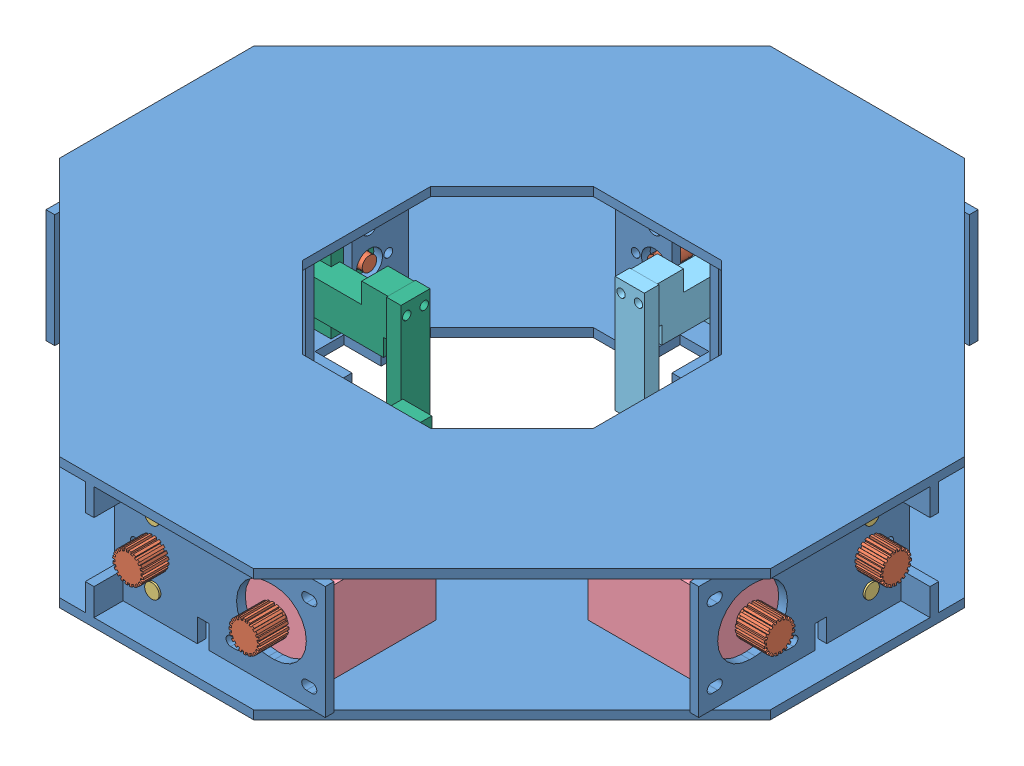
SolidWorks assembly assembly.SLDASM, configuration 默认 (file format 11000). Lengths in mm.
Overall size (244.4 53 244.4).
35 component instances, 6 part files, 15 mates.
Components (placement in the parent):
- 双轴拉伸v2.0-1: 双轴拉伸v2.0.SLDPRT [默认] at origin size (244.4 45 244.4)
- 双轴拉伸v2.0-转轴-1: 双轴拉伸v2.0-转轴.SLDPRT [默认] at (60 52.5 -11) x (1 0 0) z (0 -0.674132 -0.73861) size (61 10.6 10.6)
- 双轴拉伸v2.0-滑轨-1: 双轴拉伸v2.0-滑轨.SLDPRT [默认] at (62.801 51.5 -11) x (0 0 -1) z (1 0 0) size (5 27 50)
- 双轴拉伸v2.0-电机-1: 双轴拉伸v2.0-电机.SLDPRT [默认] at (69.2 52 29) x (0 0 -1) z (1 0 0) size (28 28 40)
- 双轴拉伸v2.0-转轴-2: 双轴拉伸v2.0-转轴.SLDPRT [默认] at (60 52 29) x (1 0 0) z (0 0.249485 0.968379) size (61 10.6 10.6)
- 双轴拉伸v2.0-转轴-3: 双轴拉伸v2.0-转轴.SLDPRT [默认] at (-60 52.5 -11) x (-1 0 0) z (0 0.674132 0.73861) size (61 10.6 10.6) (suppressed, hidden)
- 双轴拉伸v2.0-滑轨-2: 双轴拉伸v2.0-滑轨.SLDPRT [默认] at (-112.801 51.5 -11) x (0 0 -1) z (1 0 0) size (5 27 50) (suppressed, hidden)
- 双轴拉伸v2.0-转轴-4: 双轴拉伸v2.0-转轴.SLDPRT [默认] at (-60 49 27) x (-1 0 0) z (0 -0.249485 -0.968379) size (61 10.6 10.6) (suppressed, hidden)
- 双轴拉伸v2.0-电机-2: 双轴拉伸v2.0-电机.SLDPRT [默认] at (-109.2 49 27) x (0 0 -1) z (1 0 0) size (28 28 40) (suppressed, hidden)
- 双轴拉伸v2.0-电机-3: 双轴拉伸v2.0-电机.SLDPRT [默认] at (27 49 109.2) x (-1 0 0) z (0 0 -1) size (28 28 40) (suppressed, hidden)
- 双轴拉伸v2.0-转轴-5: 双轴拉伸v2.0-转轴.SLDPRT [默认] at (-11 52.5 60) x (0 0 1) z (0.73861 0.674132 0) size (61 10.6 10.6) (suppressed, hidden)
- 双轴拉伸v2.0-转轴-6: 双轴拉伸v2.0-转轴.SLDPRT [默认] at (27 49 60) x (0 0 1) z (-0.968379 -0.249485 0) size (61 10.6 10.6) (suppressed, hidden)
- 双轴拉伸v2.0-电机-4: 双轴拉伸v2.0-电机.SLDPRT [默认] at (27 49 -69.2) x (-1 0 0) z (0 0 -1) size (28 28 40) (suppressed, hidden)
- 双轴拉伸v2.0-转轴-7: 双轴拉伸v2.0-转轴.SLDPRT [默认] at (27 49 -60) x (0 0 -1) z (0.968379 0.249485 0) size (61 10.6 10.6) (suppressed, hidden)
- 双轴拉伸v2.0-滑轨-3: 双轴拉伸v2.0-滑轨.SLDPRT [默认] at (-11 51.5 -62.801) x (-1 0 0) z (0 0 -1) size (5 27 50) (suppressed, hidden)
- 双轴拉伸v2.0-转轴-8: 双轴拉伸v2.0-转轴.SLDPRT [默认] at (-11 52.5 -60) x (0 0 -1) z (-0.73861 -0.674132 0) size (61 10.6 10.6) (suppressed, hidden)
- 双轴拉伸v2.0-滑块-6: 双轴拉伸v2.0-滑块.SLDPRT [默认] at (88.6868 33.5 -4) size (51.7 49.5 26)
- 双轴拉伸v2.0-滑块-7: 双轴拉伸v2.0-滑块.SLDPRT [默认] at (-81.5799 33.5 -11) x (-1 0 0) z (0 0 -1) size (51.7 49.5 26) (suppressed, hidden)
- 双轴拉伸v2.0-滑块-8: 双轴拉伸v2.0-滑块.SLDPRT [默认] at (-11 33.5 81.5799) x (0 0 1) z (-1 0 0) size (51.7 49.5 26) (suppressed, hidden)
- 双轴拉伸v2.0-滑块-9: 双轴拉伸v2.0-滑块.SLDPRT [默认] at (-4 33.5 -81.5799) x (0 0 -1) z (1 0 0) size (51.7 49.5 26) (suppressed, hidden)
- 双轴拉伸v2.0-转轴-11: 双轴拉伸v2.0-转轴.SLDPRT [默认] at (29 52 -60) x (0 0 -1) z (0.968379 0.249485 0) size (61 10.6 10.6)
- 双轴拉伸v2.0-电机-6: 双轴拉伸v2.0-电机.SLDPRT [默认] at (29 52 -69.2) x (-1 0 0) z (0 0 -1) size (28 28 40)
- 双轴拉伸v2.0-转轴-12: 双轴拉伸v2.0-转轴.SLDPRT [默认] at (-11 52.5 -60) x (0 0 -1) z (-0.73861 -0.674132 0) size (61 10.6 10.6)
- 双轴拉伸v2.0-滑轨-5: 双轴拉伸v2.0-滑轨.SLDPRT [默认] at (-11 51.5 -62.801) x (-1 0 0) z (0 0 -1) size (5 27 50)
- 双轴拉伸v2.0-滑块-11: 双轴拉伸v2.0-滑块.SLDPRT [默认] at (-4 33.5 -88.6868) x (0 0 -1) z (1 0 0) size (51.7 49.5 26)
- 双轴拉伸v2.0-滑轨-6: 双轴拉伸v2.0-滑轨.SLDPRT [默认] at (-11 51.5 112.801) x (-1 0 0) z (0 0 -1) size (5 27 50)
- 双轴拉伸v2.0-转轴-13: 双轴拉伸v2.0-转轴.SLDPRT [默认] at (-11 52.5 60) x (0 0 1) z (0.73861 0.674132 0) size (61 10.6 10.6)
- 双轴拉伸v2.0-电机-8: 双轴拉伸v2.0-电机.SLDPRT [默认] at (29 52 109.2) x (-1 0 0) z (0 0 -1) size (28 28 40)
- 双轴拉伸v2.0-转轴-16: 双轴拉伸v2.0-转轴.SLDPRT [默认] at (29 52 60) x (0 0 1) z (-0.968379 -0.249485 0) size (61 10.6 10.6)
- 双轴拉伸v2.0-滑轨-8: 双轴拉伸v2.0-滑轨.SLDPRT [默认] at (-112.801 51.5 -11) x (0 0 -1) z (1 0 0) size (5 27 50)
- 双轴拉伸v2.0-转轴-17: 双轴拉伸v2.0-转轴.SLDPRT [默认] at (-60 52.5 -11) x (-1 0 0) z (0 0.674132 0.73861) size (61 10.6 10.6)
- 双轴拉伸v2.0-电机-9: 双轴拉伸v2.0-电机.SLDPRT [默认] at (-109.2 52 29) x (0 0 -1) z (1 0 0) size (28 28 40)
- 双轴拉伸v2.0-转轴-18: 双轴拉伸v2.0-转轴.SLDPRT [默认] at (-60 52 29) x (-1 0 0) z (0 -0.249485 -0.968379) size (61 10.6 10.6)
- 双轴拉伸v2.0-滑块2-1: 双轴拉伸v2.0-滑块2.SLDPRT [默认] at (-81.3781 33.5 36) x (-1 0 0) z (0 0 -1) size (51.7 49.5 26)
- 双轴拉伸v2.0-滑块2-2: 双轴拉伸v2.0-滑块2.SLDPRT [默认] at (36 33.5 81.7684) x (0 0 1) z (-1 0 0) size (51.7 49.5 26)
Mates (geometry in assembly coordinates):
- 同心1: concentric: cylinder of 双轴拉伸v2.0-1 through (-122.2 63.5 -11) axis (1 0 0) radius 2.5; cylinder of 双轴拉伸v2.0-滑轨-1 through (112.801 63.5 -11) axis (-1 0 0) radius 2.5
- 同心2: concentric: cylinder of 双轴拉伸v2.0-1 through (-122.2 41.5 -11) axis (1 0 0) radius 2.5; cylinder of 双轴拉伸v2.0-滑轨-1 through (112.801 41.5 -11) axis (-1 0 0) radius 2.5
- 同心3: concentric: cylinder of 双轴拉伸v2.0-1 through (-122.2 52.5 -11) axis (1 0 0) radius 4.5; cylinder of 双轴拉伸v2.0-转轴-1 through (28.3566 52.5 -11) axis (-1 0 0) radius 3
- 重合1: coincident: plane of 双轴拉伸v2.0-1 through (60 -3 -12) normal (-1 0 0); plane of 双轴拉伸v2.0-转轴-1 through (60 52.5 -11) normal (-1 0 0)
- 重合4: coincident: plane of 双轴拉伸v2.0-1 through (109.2 0 0) normal (-1 0 0); plane of 双轴拉伸v2.0-电机-1 through (109.2 52 29) normal (1 0 0)
- 距离1: distance = 5 mm: plane of 双轴拉伸v2.0-电机-1 through (109.2 38 43) normal (0 -1 0); plane of 双轴拉伸v2.0-1 through (60 33 -500000) normal (0 1 0)
- 距离2: distance = 4 mm: plane of 双轴拉伸v2.0-电机-1 through (109.2 38 15) normal (0 0 -1); plane of 双轴拉伸v2.0-1 through (0 0 11) normal (0 0 1)
- 同心7: concentric: cylinder of 双轴拉伸v2.0-电机-1 through (109.2 52 29) axis (-1 0 0) radius 3; cylinder of 双轴拉伸v2.0-转轴-2 through (28.3566 52 29) axis (-1 0 0) radius 3
- 重合7: coincident: plane of 双轴拉伸v2.0-转轴-1 through (121 50.6535 -9.3147) normal (1 0 0); plane of 双轴拉伸v2.0-转轴-2 through (121 54.4209 28.3763) normal (1 0 0)
- 齿轮配合2: gear = 10.6 mm: circle of 双轴拉伸v2.0-转轴-2; circle of 双轴拉伸v2.0-转轴-1
- 同心10: concentric: cylinder of 双轴拉伸v2.0-滑轨-1 through (112.801 63.5 -11) axis (-1 0 0) radius 2.5; cylinder of 双轴拉伸v2.0-滑块-6 through (91.6868 63.5 -11) axis (-1 0 0) radius 3
- 同心11: concentric: cylinder of 双轴拉伸v2.0-滑轨-1 through (112.801 41.5 -11) axis (-1 0 0) radius 2.5; cylinder of 双轴拉伸v2.0-滑块-6 through (91.6868 41.5 -11) axis (-1 0 0) radius 3
- 同心12: concentric: cylinder of 双轴拉伸v2.0-滑轨-8 through (-62.801 63.5 -11) axis (-1 0 0) radius 2.5; cylinder of 双轴拉伸v2.0-滑块2-1 through (-66.1781 63.5 -11) axis (1 0 0) radius 5
- 同心13: concentric: cylinder of 双轴拉伸v2.0-滑轨-6 through (-11 63.5 62.801) axis (0 0 1) radius 2.5; cylinder of 双轴拉伸v2.0-滑块2-2 through (-11 63.5 84.7684) axis (0 0 -1) radius 3
- 同心14: concentric: cylinder of 双轴拉伸v2.0-滑轨-6 through (-11 41.5 62.801) axis (0 0 1) radius 2.5; cylinder of 双轴拉伸v2.0-滑块2-2 through (-11 41.5 66.5684) axis (0 0 -1) radius 5
